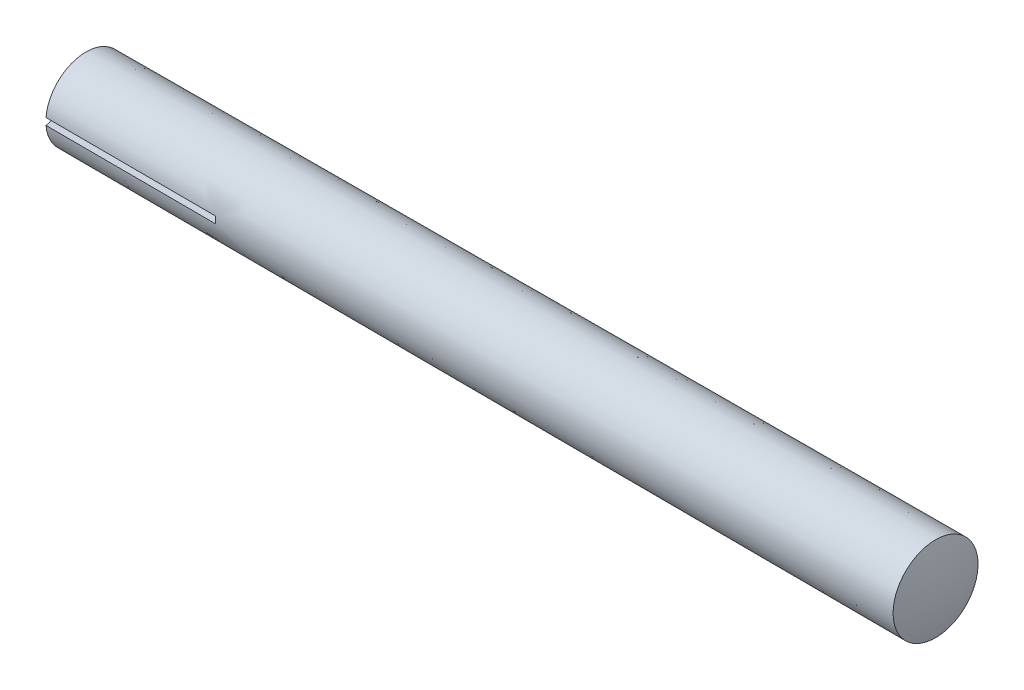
from build123d import *

# Parameters (mm, degrees)
SPLSKE_W                       = 12.7
SPLSKE_H                       = 0.508
SPLIT_2_DEPTH                  = 12.7
SPLIT_2_DIRECTION_2_REACH      = 66.061
SPLIT_2_DIRECTION_2_END_RADIUS = 12.7


with BuildPart() as part:
    # BodySke → BaseBody (revolve)
    with BuildSketch(Plane.XY):
        with BuildLine():
            Line((-0.361762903, 0), (63.903277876, 0))
            ThreePointArc((63.903277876, 0), (63.802055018, 1.600254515), (63.5, 3.175))
            Line((63.5, 3.175), (0, 3.009635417))
            ThreePointArc((0, 3.009635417), (-0.270997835, 1.515649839), (-0.361762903, 0))
        make_face()
    revolve(axis=Axis((-103.417362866, 0, 0), (1, 0, 0)))

    # SplSke → Split 2 (cut)
    with BuildSketch(Plane(origin=(0, 0, 0), x_dir=(0, 0, -1), z_dir=(1, 0, 0))):
        Rectangle(SPLSKE_W, SPLSKE_H)
    extrude(amount=SPLIT_2_DEPTH, mode=Mode.SUBTRACT)

    # Split 2 direction 2: up to this sphere (the profile starts inside it)
    split_2_direction_2_end = Location((12.338237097, 0, 0)) * Sphere(SPLIT_2_DIRECTION_2_END_RADIUS, mode=Mode.PRIVATE)
    # SplSke → Split 2 direction 2 (cut, up to the surface)
    with BuildSketch(Plane(origin=(0, 0, 0), x_dir=(0, 0, -1), z_dir=(1, 0, 0)), mode=Mode.PRIVATE) as split_2_direction_2_sk1:
        Rectangle(SPLSKE_W, SPLSKE_H)
    split_2_direction_2_tool1 = extrude(split_2_direction_2_sk1.sketch, amount=-SPLIT_2_DIRECTION_2_REACH, mode=Mode.PRIVATE) & split_2_direction_2_end
    add(split_2_direction_2_tool1.solids().sort_by_distance((0, 0, 0))[0], mode=Mode.SUBTRACT)


solid = part.part
